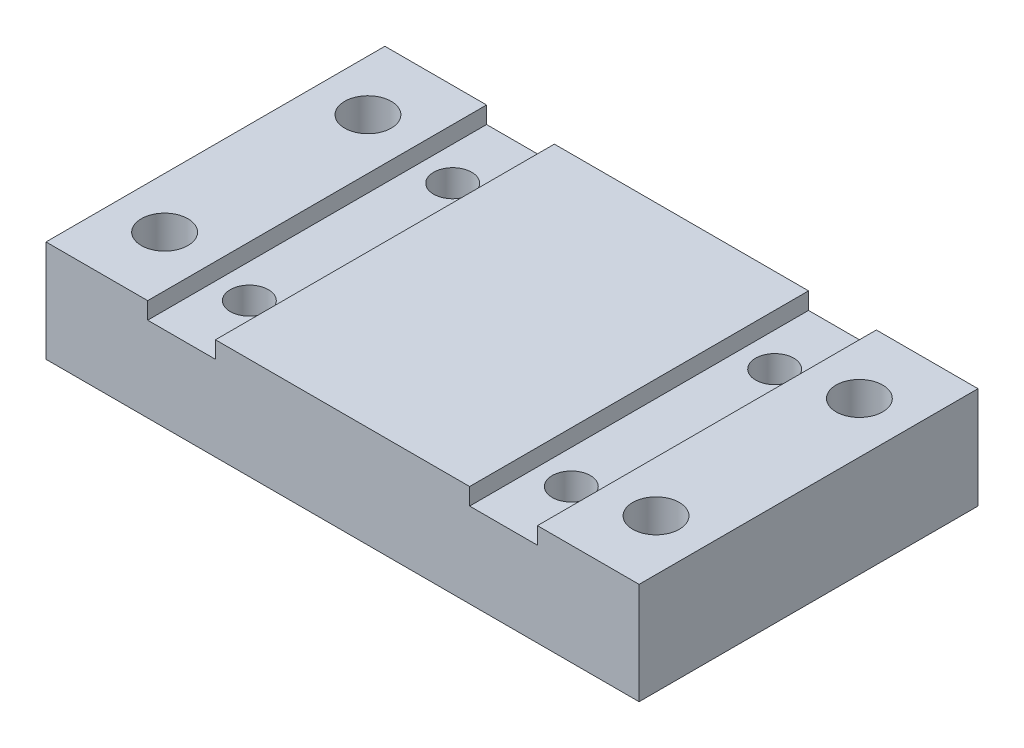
ISO-10303-21;
HEADER;
FILE_DESCRIPTION(('STEP AP214'),'2;1');
FILE_NAME('part.step','',(''),(''),'','','');
FILE_SCHEMA(('AUTOMOTIVE_DESIGN { 1 0 10303 214 1 1 1 1 }'));
ENDSEC;
DATA;
#1=APPLICATION_CONTEXT('core data for automotive mechanical design processes');
#2=APPLICATION_PROTOCOL_DEFINITION('international standard','automotive_design',2000,#1);
#3=PRODUCT_CONTEXT('',#1,'mechanical');
#4=PRODUCT('Part','Part','',(#3));
#5=PRODUCT_RELATED_PRODUCT_CATEGORY('part','',(#4));
#6=PRODUCT_DEFINITION_FORMATION('','',#4);
#7=PRODUCT_DEFINITION_CONTEXT('part definition',#1,'design');
#8=PRODUCT_DEFINITION('design','',#6,#7);
#9=PRODUCT_DEFINITION_SHAPE('','',#8);
#10=(LENGTH_UNIT() NAMED_UNIT(*) SI_UNIT(.MILLI.,.METRE.));
#11=(NAMED_UNIT(*) PLANE_ANGLE_UNIT() SI_UNIT($,.RADIAN.));
#12=(NAMED_UNIT(*) SI_UNIT($,.STERADIAN.) SOLID_ANGLE_UNIT());
#13=UNCERTAINTY_MEASURE_WITH_UNIT(LENGTH_MEASURE(1.E-05),#10,'distance_accuracy_value','');
#14=(GEOMETRIC_REPRESENTATION_CONTEXT(3) GLOBAL_UNCERTAINTY_ASSIGNED_CONTEXT((#13)) GLOBAL_UNIT_ASSIGNED_CONTEXT((#10,
#11,#12)) REPRESENTATION_CONTEXT('',''));
#15=CARTESIAN_POINT('',(0.,0.,0.));
#16=DIRECTION('',(0.,0.,1.));
#17=DIRECTION('',(1.,0.,0.));
#18=AXIS2_PLACEMENT_3D('',#15,#16,#17);
#19=CARTESIAN_POINT('',(-19.,0.,12.));
#20=DIRECTION('',(0.,1.,0.));
#21=DIRECTION('',(0.,0.,1.));
#22=AXIS2_PLACEMENT_3D('',#19,#20,#21);
#23=CYLINDRICAL_SURFACE('',#22,2.25);
#24=CARTESIAN_POINT('',(-19.,10.,12.));
#25=DIRECTION('',(0.,1.,0.));
#26=DIRECTION('',(0.,0.,1.));
#27=AXIS2_PLACEMENT_3D('',#24,#25,#26);
#28=CIRCLE('',#27,2.25);
#29=CARTESIAN_POINT('',(-19.,10.,14.25));
#30=VERTEX_POINT('',#29);
#31=EDGE_CURVE('E159',#30,#30,#28,.T.);
#32=ORIENTED_EDGE('',*,*,#31,.T.);
#33=EDGE_LOOP('',(#32));
#34=FACE_BOUND('',#33,.T.);
#35=CARTESIAN_POINT('',(-19.,4.,12.));
#36=DIRECTION('',(0.,1.,0.));
#37=DIRECTION('',(0.,0.,1.));
#38=AXIS2_PLACEMENT_3D('',#35,#36,#37);
#39=CIRCLE('',#38,2.25);
#40=CARTESIAN_POINT('',(-19.,4.,14.25));
#41=VERTEX_POINT('',#40);
#42=EDGE_CURVE('E162',#41,#41,#39,.T.);
#43=ORIENTED_EDGE('',*,*,#42,.F.);
#44=EDGE_LOOP('',(#43));
#45=FACE_BOUND('',#44,.T.);
#46=ADVANCED_FACE('F17',(#34,#45),#23,.F.);
#47=CARTESIAN_POINT('',(-19.,0.,-12.));
#48=DIRECTION('',(0.,1.,0.));
#49=DIRECTION('',(0.,0.,1.));
#50=AXIS2_PLACEMENT_3D('',#47,#48,#49);
#51=CYLINDRICAL_SURFACE('',#50,2.25);
#52=CARTESIAN_POINT('',(-19.,10.,-12.));
#53=DIRECTION('',(0.,1.,0.));
#54=DIRECTION('',(0.,0.,1.));
#55=AXIS2_PLACEMENT_3D('',#52,#53,#54);
#56=CIRCLE('',#55,2.25);
#57=CARTESIAN_POINT('',(-19.,10.,-9.74999999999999));
#58=VERTEX_POINT('',#57);
#59=EDGE_CURVE('E156',#58,#58,#56,.T.);
#60=ORIENTED_EDGE('',*,*,#59,.T.);
#61=EDGE_LOOP('',(#60));
#62=FACE_BOUND('',#61,.T.);
#63=CARTESIAN_POINT('',(-19.,4.,-12.));
#64=DIRECTION('',(0.,1.,0.));
#65=DIRECTION('',(0.,0.,1.));
#66=AXIS2_PLACEMENT_3D('',#63,#64,#65);
#67=CIRCLE('',#66,2.25);
#68=CARTESIAN_POINT('',(-19.,4.,-9.74999999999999));
#69=VERTEX_POINT('',#68);
#70=EDGE_CURVE('E221',#69,#69,#67,.T.);
#71=ORIENTED_EDGE('',*,*,#70,.F.);
#72=EDGE_LOOP('',(#71));
#73=FACE_BOUND('',#72,.T.);
#74=ADVANCED_FACE('F245',(#62,#73),#51,.F.);
#75=CARTESIAN_POINT('',(19.,0.,-12.));
#76=DIRECTION('',(0.,1.,0.));
#77=DIRECTION('',(0.,0.,1.));
#78=AXIS2_PLACEMENT_3D('',#75,#76,#77);
#79=CYLINDRICAL_SURFACE('',#78,2.25);
#80=CARTESIAN_POINT('',(19.,10.,-12.));
#81=DIRECTION('',(0.,1.,0.));
#82=DIRECTION('',(0.,0.,1.));
#83=AXIS2_PLACEMENT_3D('',#80,#81,#82);
#84=CIRCLE('',#83,2.25);
#85=CARTESIAN_POINT('',(19.,10.,-9.74999999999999));
#86=VERTEX_POINT('',#85);
#87=EDGE_CURVE('E150',#86,#86,#84,.T.);
#88=ORIENTED_EDGE('',*,*,#87,.T.);
#89=EDGE_LOOP('',(#88));
#90=FACE_BOUND('',#89,.T.);
#91=CARTESIAN_POINT('',(19.,4.,-12.));
#92=DIRECTION('',(0.,1.,0.));
#93=DIRECTION('',(0.,0.,1.));
#94=AXIS2_PLACEMENT_3D('',#91,#92,#93);
#95=CIRCLE('',#94,2.25);
#96=CARTESIAN_POINT('',(19.,4.,-9.74999999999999));
#97=VERTEX_POINT('',#96);
#98=EDGE_CURVE('E223',#97,#97,#95,.T.);
#99=ORIENTED_EDGE('',*,*,#98,.F.);
#100=EDGE_LOOP('',(#99));
#101=FACE_BOUND('',#100,.T.);
#102=ADVANCED_FACE('F235',(#90,#101),#79,.F.);
#103=CARTESIAN_POINT('',(19.,0.,12.));
#104=DIRECTION('',(0.,1.,0.));
#105=DIRECTION('',(0.,0.,1.));
#106=AXIS2_PLACEMENT_3D('',#103,#104,#105);
#107=CYLINDRICAL_SURFACE('',#106,2.25);
#108=CARTESIAN_POINT('',(19.,10.,12.));
#109=DIRECTION('',(0.,1.,0.));
#110=DIRECTION('',(0.,0.,1.));
#111=AXIS2_PLACEMENT_3D('',#108,#109,#110);
#112=CIRCLE('',#111,2.25);
#113=CARTESIAN_POINT('',(19.,10.,14.25));
#114=VERTEX_POINT('',#113);
#115=EDGE_CURVE('E148',#114,#114,#112,.T.);
#116=ORIENTED_EDGE('',*,*,#115,.T.);
#117=EDGE_LOOP('',(#116));
#118=FACE_BOUND('',#117,.T.);
#119=CARTESIAN_POINT('',(19.,4.,12.));
#120=DIRECTION('',(0.,1.,0.));
#121=DIRECTION('',(0.,0.,1.));
#122=AXIS2_PLACEMENT_3D('',#119,#120,#121);
#123=CIRCLE('',#122,2.25);
#124=CARTESIAN_POINT('',(19.,4.,14.25));
#125=VERTEX_POINT('',#124);
#126=EDGE_CURVE('E20',#125,#125,#123,.T.);
#127=ORIENTED_EDGE('',*,*,#126,.F.);
#128=EDGE_LOOP('',(#127));
#129=FACE_BOUND('',#128,.T.);
#130=ADVANCED_FACE('F233',(#118,#129),#107,.F.);
#131=CARTESIAN_POINT('',(19.,4.,12.));
#132=DIRECTION('',(0.,-1.,0.));
#133=DIRECTION('',(0.,0.,-1.));
#134=AXIS2_PLACEMENT_3D('',#131,#132,#133);
#135=PLANE('',#134);
#136=ORIENTED_EDGE('',*,*,#126,.T.);
#137=EDGE_LOOP('',(#136));
#138=FACE_BOUND('',#137,.T.);
#139=CARTESIAN_POINT('',(19.,4.,12.));
#140=DIRECTION('',(0.,-1.,0.));
#141=DIRECTION('',(0.,0.,-1.));
#142=AXIS2_PLACEMENT_3D('',#139,#140,#141);
#143=CIRCLE('',#142,4.);
#144=CARTESIAN_POINT('',(19.,4.,8.00000000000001));
#145=VERTEX_POINT('',#144);
#146=EDGE_CURVE('E145',#145,#145,#143,.T.);
#147=ORIENTED_EDGE('',*,*,#146,.T.);
#148=EDGE_LOOP('',(#147));
#149=FACE_BOUND('',#148,.T.);
#150=ADVANCED_FACE('F230',(#138,#149),#135,.T.);
#151=CARTESIAN_POINT('',(19.,4.,-12.));
#152=DIRECTION('',(0.,-1.,0.));
#153=DIRECTION('',(0.,0.,-1.));
#154=AXIS2_PLACEMENT_3D('',#151,#152,#153);
#155=PLANE('',#154);
#156=ORIENTED_EDGE('',*,*,#98,.T.);
#157=EDGE_LOOP('',(#156));
#158=FACE_BOUND('',#157,.T.);
#159=CARTESIAN_POINT('',(19.,4.,-12.));
#160=DIRECTION('',(0.,-1.,0.));
#161=DIRECTION('',(0.,0.,-1.));
#162=AXIS2_PLACEMENT_3D('',#159,#160,#161);
#163=CIRCLE('',#162,4.);
#164=CARTESIAN_POINT('',(19.,4.,-16.));
#165=VERTEX_POINT('',#164);
#166=EDGE_CURVE('E206',#165,#165,#163,.T.);
#167=ORIENTED_EDGE('',*,*,#166,.T.);
#168=EDGE_LOOP('',(#167));
#169=FACE_BOUND('',#168,.T.);
#170=ADVANCED_FACE('F243',(#158,#169),#155,.T.);
#171=CARTESIAN_POINT('',(-19.,4.,-12.));
#172=DIRECTION('',(0.,-1.,0.));
#173=DIRECTION('',(0.,0.,-1.));
#174=AXIS2_PLACEMENT_3D('',#171,#172,#173);
#175=PLANE('',#174);
#176=ORIENTED_EDGE('',*,*,#70,.T.);
#177=EDGE_LOOP('',(#176));
#178=FACE_BOUND('',#177,.T.);
#179=CARTESIAN_POINT('',(-19.,4.,-12.));
#180=DIRECTION('',(0.,-1.,0.));
#181=DIRECTION('',(0.,0.,-1.));
#182=AXIS2_PLACEMENT_3D('',#179,#180,#181);
#183=CIRCLE('',#182,4.);
#184=CARTESIAN_POINT('',(-19.,4.,-16.));
#185=VERTEX_POINT('',#184);
#186=EDGE_CURVE('E203',#185,#185,#183,.T.);
#187=ORIENTED_EDGE('',*,*,#186,.T.);
#188=EDGE_LOOP('',(#187));
#189=FACE_BOUND('',#188,.T.);
#190=ADVANCED_FACE('F336',(#178,#189),#175,.T.);
#191=CARTESIAN_POINT('',(-19.,4.,12.));
#192=DIRECTION('',(0.,-1.,0.));
#193=DIRECTION('',(0.,0.,-1.));
#194=AXIS2_PLACEMENT_3D('',#191,#192,#193);
#195=PLANE('',#194);
#196=ORIENTED_EDGE('',*,*,#42,.T.);
#197=EDGE_LOOP('',(#196));
#198=FACE_BOUND('',#197,.T.);
#199=CARTESIAN_POINT('',(-19.,4.,12.));
#200=DIRECTION('',(0.,-1.,0.));
#201=DIRECTION('',(0.,0.,-1.));
#202=AXIS2_PLACEMENT_3D('',#199,#200,#201);
#203=CIRCLE('',#202,4.);
#204=CARTESIAN_POINT('',(-19.,4.,8.00000000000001));
#205=VERTEX_POINT('',#204);
#206=EDGE_CURVE('E200',#205,#205,#203,.T.);
#207=ORIENTED_EDGE('',*,*,#206,.T.);
#208=EDGE_LOOP('',(#207));
#209=FACE_BOUND('',#208,.T.);
#210=ADVANCED_FACE('F332',(#198,#209),#195,.T.);
#211=CARTESIAN_POINT('',(15.,14.,-20.));
#212=DIRECTION('',(-1.,0.,0.));
#213=DIRECTION('',(0.,-1.,0.));
#214=AXIS2_PLACEMENT_3D('',#211,#212,#213);
#215=PLANE('',#214);
#216=DIRECTION('',(0.,0.,-1.));
#217=VECTOR('',#216,1.);
#218=CARTESIAN_POINT('',(15.,10.,-20.));
#219=LINE('',#218,#217);
#220=CARTESIAN_POINT('',(15.,10.,20.));
#221=VERTEX_POINT('',#220);
#222=CARTESIAN_POINT('',(15.,10.,-20.));
#223=VERTEX_POINT('',#222);
#224=EDGE_CURVE('E146',#221,#223,#219,.T.);
#225=ORIENTED_EDGE('',*,*,#224,.T.);
#226=DIRECTION('',(0.,1.,0.));
#227=VECTOR('',#226,1.);
#228=CARTESIAN_POINT('',(15.,12.,-20.));
#229=LINE('',#228,#227);
#230=CARTESIAN_POINT('',(15.,12.,-20.));
#231=VERTEX_POINT('',#230);
#232=EDGE_CURVE('E549',#223,#231,#229,.T.);
#233=ORIENTED_EDGE('',*,*,#232,.T.);
#234=DIRECTION('',(0.,0.,-1.));
#235=VECTOR('',#234,1.);
#236=CARTESIAN_POINT('',(15.,12.,0.));
#237=LINE('',#236,#235);
#238=CARTESIAN_POINT('',(15.,12.,20.));
#239=VERTEX_POINT('',#238);
#240=EDGE_CURVE('E160',#231,#239,#237,.F.);
#241=ORIENTED_EDGE('',*,*,#240,.T.);
#242=DIRECTION('',(0.,1.,0.));
#243=VECTOR('',#242,1.);
#244=CARTESIAN_POINT('',(15.,12.,20.));
#245=LINE('',#244,#243);
#246=EDGE_CURVE('E552',#239,#221,#245,.F.);
#247=ORIENTED_EDGE('',*,*,#246,.T.);
#248=EDGE_LOOP('',(#225,#233,#241,#247));
#249=FACE_BOUND('',#248,.T.);
#250=ADVANCED_FACE('F328',(#249),#215,.F.);
#251=CARTESIAN_POINT('',(0.,12.,0.));
#252=DIRECTION('',(0.,-1.,0.));
#253=DIRECTION('',(0.,0.,-1.));
#254=AXIS2_PLACEMENT_3D('',#251,#252,#253);
#255=PLANE('',#254);
#256=ORIENTED_EDGE('',*,*,#240,.F.);
#257=DIRECTION('',(1.,0.,0.));
#258=VECTOR('',#257,1.);
#259=CARTESIAN_POINT('',(-35.,12.,-20.));
#260=LINE('',#259,#258);
#261=CARTESIAN_POINT('',(-15.,12.,-20.));
#262=VERTEX_POINT('',#261);
#263=EDGE_CURVE('E563',#231,#262,#260,.F.);
#264=ORIENTED_EDGE('',*,*,#263,.T.);
#265=DIRECTION('',(0.,0.,1.));
#266=VECTOR('',#265,1.);
#267=CARTESIAN_POINT('',(-15.,12.,-20.));
#268=LINE('',#267,#266);
#269=CARTESIAN_POINT('',(-15.,12.,20.));
#270=VERTEX_POINT('',#269);
#271=EDGE_CURVE('E157',#262,#270,#268,.T.);
#272=ORIENTED_EDGE('',*,*,#271,.T.);
#273=DIRECTION('',(-1.,0.,0.));
#274=VECTOR('',#273,1.);
#275=CARTESIAN_POINT('',(-35.,12.,20.));
#276=LINE('',#275,#274);
#277=EDGE_CURVE('E576',#270,#239,#276,.F.);
#278=ORIENTED_EDGE('',*,*,#277,.T.);
#279=EDGE_LOOP('',(#256,#264,#272,#278));
#280=FACE_BOUND('',#279,.T.);
#281=ADVANCED_FACE('F324',(#280),#255,.F.);
#282=CARTESIAN_POINT('',(-15.,14.,-20.));
#283=DIRECTION('',(1.,0.,0.));
#284=DIRECTION('',(0.,1.,0.));
#285=AXIS2_PLACEMENT_3D('',#282,#283,#284);
#286=PLANE('',#285);
#287=DIRECTION('',(0.,0.,-1.));
#288=VECTOR('',#287,1.);
#289=CARTESIAN_POINT('',(-15.,10.,-20.));
#290=LINE('',#289,#288);
#291=CARTESIAN_POINT('',(-15.,10.,-20.));
#292=VERTEX_POINT('',#291);
#293=CARTESIAN_POINT('',(-15.,10.,20.));
#294=VERTEX_POINT('',#293);
#295=EDGE_CURVE('E154',#292,#294,#290,.F.);
#296=ORIENTED_EDGE('',*,*,#295,.T.);
#297=DIRECTION('',(0.,1.,0.));
#298=VECTOR('',#297,1.);
#299=CARTESIAN_POINT('',(-15.,12.,20.));
#300=LINE('',#299,#298);
#301=EDGE_CURVE('E579',#294,#270,#300,.T.);
#302=ORIENTED_EDGE('',*,*,#301,.T.);
#303=ORIENTED_EDGE('',*,*,#271,.F.);
#304=DIRECTION('',(0.,1.,0.));
#305=VECTOR('',#304,1.);
#306=CARTESIAN_POINT('',(-15.,12.,-20.));
#307=LINE('',#306,#305);
#308=EDGE_CURVE('E566',#262,#292,#307,.F.);
#309=ORIENTED_EDGE('',*,*,#308,.T.);
#310=EDGE_LOOP('',(#296,#302,#303,#309));
#311=FACE_BOUND('',#310,.T.);
#312=ADVANCED_FACE('F320',(#311),#286,.F.);
#313=CARTESIAN_POINT('',(-23.,10.,-20.));
#314=DIRECTION('',(0.,-1.,0.));
#315=DIRECTION('',(0.,0.,-1.));
#316=AXIS2_PLACEMENT_3D('',#313,#314,#315);
#317=PLANE('',#316);
#318=ORIENTED_EDGE('',*,*,#295,.F.);
#319=DIRECTION('',(1.,0.,0.));
#320=VECTOR('',#319,1.);
#321=CARTESIAN_POINT('',(-35.,10.,-20.));
#322=LINE('',#321,#320);
#323=CARTESIAN_POINT('',(-23.,10.,-20.));
#324=VERTEX_POINT('',#323);
#325=EDGE_CURVE('E593',#292,#324,#322,.F.);
#326=ORIENTED_EDGE('',*,*,#325,.T.);
#327=DIRECTION('',(0.,0.,1.));
#328=VECTOR('',#327,1.);
#329=CARTESIAN_POINT('',(-23.,10.,-20.));
#330=LINE('',#329,#328);
#331=CARTESIAN_POINT('',(-23.,10.,20.));
#332=VERTEX_POINT('',#331);
#333=EDGE_CURVE('E152',#324,#332,#330,.T.);
#334=ORIENTED_EDGE('',*,*,#333,.T.);
#335=DIRECTION('',(-1.,0.,0.));
#336=VECTOR('',#335,1.);
#337=CARTESIAN_POINT('',(-35.,10.,20.));
#338=LINE('',#337,#336);
#339=EDGE_CURVE('E582',#332,#294,#338,.F.);
#340=ORIENTED_EDGE('',*,*,#339,.T.);
#341=EDGE_LOOP('',(#318,#326,#334,#340));
#342=FACE_BOUND('',#341,.T.);
#343=ORIENTED_EDGE('',*,*,#59,.F.);
#344=EDGE_LOOP('',(#343));
#345=FACE_BOUND('',#344,.T.);
#346=ORIENTED_EDGE('',*,*,#31,.F.);
#347=EDGE_LOOP('',(#346));
#348=FACE_BOUND('',#347,.T.);
#349=ADVANCED_FACE('F317',(#342,#345,#348),#317,.F.);
#350=CARTESIAN_POINT('',(-23.,14.,-20.));
#351=DIRECTION('',(-1.,0.,0.));
#352=DIRECTION('',(0.,0.,1.));
#353=AXIS2_PLACEMENT_3D('',#350,#351,#352);
#354=PLANE('',#353);
#355=ORIENTED_EDGE('',*,*,#333,.F.);
#356=DIRECTION('',(0.,1.,0.));
#357=VECTOR('',#356,1.);
#358=CARTESIAN_POINT('',(-23.,12.,-20.));
#359=LINE('',#358,#357);
#360=CARTESIAN_POINT('',(-23.,12.,-20.));
#361=VERTEX_POINT('',#360);
#362=EDGE_CURVE('E594',#324,#361,#359,.T.);
#363=ORIENTED_EDGE('',*,*,#362,.T.);
#364=DIRECTION('',(0.,0.,-1.));
#365=VECTOR('',#364,1.);
#366=CARTESIAN_POINT('',(-23.,12.,0.));
#367=LINE('',#366,#365);
#368=CARTESIAN_POINT('',(-23.,12.,20.));
#369=VERTEX_POINT('',#368);
#370=EDGE_CURVE('E104',#361,#369,#367,.F.);
#371=ORIENTED_EDGE('',*,*,#370,.T.);
#372=DIRECTION('',(0.,1.,0.));
#373=VECTOR('',#372,1.);
#374=CARTESIAN_POINT('',(-23.,12.,20.));
#375=LINE('',#374,#373);
#376=EDGE_CURVE('E139',#369,#332,#375,.F.);
#377=ORIENTED_EDGE('',*,*,#376,.T.);
#378=EDGE_LOOP('',(#355,#363,#371,#377));
#379=FACE_BOUND('',#378,.T.);
#380=ADVANCED_FACE('F313',(#379),#354,.F.);
#381=CARTESIAN_POINT('',(0.,12.,0.));
#382=DIRECTION('',(0.,-1.,0.));
#383=DIRECTION('',(0.,0.,-1.));
#384=AXIS2_PLACEMENT_3D('',#381,#382,#383);
#385=PLANE('',#384);
#386=ORIENTED_EDGE('',*,*,#370,.F.);
#387=DIRECTION('',(1.,0.,0.));
#388=VECTOR('',#387,1.);
#389=CARTESIAN_POINT('',(-35.,12.,-20.));
#390=LINE('',#389,#388);
#391=CARTESIAN_POINT('',(-35.,12.,-20.));
#392=VERTEX_POINT('',#391);
#393=EDGE_CURVE('E596',#361,#392,#390,.F.);
#394=ORIENTED_EDGE('',*,*,#393,.T.);
#395=DIRECTION('',(0.,0.,-1.));
#396=VECTOR('',#395,1.);
#397=CARTESIAN_POINT('',(-35.,12.,20.));
#398=LINE('',#397,#396);
#399=CARTESIAN_POINT('',(-35.,12.,20.));
#400=VERTEX_POINT('',#399);
#401=EDGE_CURVE('E130',#392,#400,#398,.F.);
#402=ORIENTED_EDGE('',*,*,#401,.T.);
#403=DIRECTION('',(-1.,0.,0.));
#404=VECTOR('',#403,1.);
#405=CARTESIAN_POINT('',(-35.,12.,20.));
#406=LINE('',#405,#404);
#407=EDGE_CURVE('E137',#400,#369,#406,.F.);
#408=ORIENTED_EDGE('',*,*,#407,.T.);
#409=EDGE_LOOP('',(#386,#394,#402,#408));
#410=FACE_BOUND('',#409,.T.);
#411=CARTESIAN_POINT('',(-29.,12.,-12.));
#412=DIRECTION('',(0.,1.,0.));
#413=DIRECTION('',(0.,0.,1.));
#414=AXIS2_PLACEMENT_3D('',#411,#412,#413);
#415=CIRCLE('',#414,2.75);
#416=CARTESIAN_POINT('',(-29.,12.,-9.24999999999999));
#417=VERTEX_POINT('',#416);
#418=EDGE_CURVE('E119',#417,#417,#415,.F.);
#419=ORIENTED_EDGE('',*,*,#418,.T.);
#420=EDGE_LOOP('',(#419));
#421=FACE_BOUND('',#420,.T.);
#422=CARTESIAN_POINT('',(-29.,12.,12.));
#423=DIRECTION('',(0.,1.,0.));
#424=DIRECTION('',(0.,0.,1.));
#425=AXIS2_PLACEMENT_3D('',#422,#423,#424);
#426=CIRCLE('',#425,2.75);
#427=CARTESIAN_POINT('',(-29.,12.,14.75));
#428=VERTEX_POINT('',#427);
#429=EDGE_CURVE('E191',#428,#428,#426,.F.);
#430=ORIENTED_EDGE('',*,*,#429,.T.);
#431=EDGE_LOOP('',(#430));
#432=FACE_BOUND('',#431,.T.);
#433=ADVANCED_FACE('F310',(#410,#421,#432),#385,.F.);
#434=CARTESIAN_POINT('',(0.,12.,0.));
#435=DIRECTION('',(0.,-1.,0.));
#436=DIRECTION('',(0.,0.,-1.));
#437=AXIS2_PLACEMENT_3D('',#434,#435,#436);
#438=PLANE('',#437);
#439=DIRECTION('',(0.,0.,-1.));
#440=VECTOR('',#439,1.);
#441=CARTESIAN_POINT('',(23.,12.,-20.));
#442=LINE('',#441,#440);
#443=CARTESIAN_POINT('',(23.,12.,-20.));
#444=VERTEX_POINT('',#443);
#445=CARTESIAN_POINT('',(23.,12.,20.));
#446=VERTEX_POINT('',#445);
#447=EDGE_CURVE('E126',#444,#446,#442,.F.);
#448=ORIENTED_EDGE('',*,*,#447,.T.);
#449=DIRECTION('',(-1.,0.,0.));
#450=VECTOR('',#449,1.);
#451=CARTESIAN_POINT('',(-35.,12.,20.));
#452=LINE('',#451,#450);
#453=CARTESIAN_POINT('',(35.,12.,20.));
#454=VERTEX_POINT('',#453);
#455=EDGE_CURVE('E122',#446,#454,#452,.F.);
#456=ORIENTED_EDGE('',*,*,#455,.T.);
#457=DIRECTION('',(0.,0.,1.));
#458=VECTOR('',#457,1.);
#459=CARTESIAN_POINT('',(35.,12.,20.));
#460=LINE('',#459,#458);
#461=CARTESIAN_POINT('',(35.,12.,-20.));
#462=VERTEX_POINT('',#461);
#463=EDGE_CURVE('E109',#454,#462,#460,.F.);
#464=ORIENTED_EDGE('',*,*,#463,.T.);
#465=DIRECTION('',(1.,0.,0.));
#466=VECTOR('',#465,1.);
#467=CARTESIAN_POINT('',(-35.,12.,-20.));
#468=LINE('',#467,#466);
#469=EDGE_CURVE('E602',#462,#444,#468,.F.);
#470=ORIENTED_EDGE('',*,*,#469,.T.);
#471=EDGE_LOOP('',(#448,#456,#464,#470));
#472=FACE_BOUND('',#471,.T.);
#473=CARTESIAN_POINT('',(29.,12.,-12.));
#474=DIRECTION('',(0.,1.,0.));
#475=DIRECTION('',(0.,0.,1.));
#476=AXIS2_PLACEMENT_3D('',#473,#474,#475);
#477=CIRCLE('',#476,2.75);
#478=CARTESIAN_POINT('',(29.,12.,-9.24999999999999));
#479=VERTEX_POINT('',#478);
#480=EDGE_CURVE('E194',#479,#479,#477,.F.);
#481=ORIENTED_EDGE('',*,*,#480,.T.);
#482=EDGE_LOOP('',(#481));
#483=FACE_BOUND('',#482,.T.);
#484=CARTESIAN_POINT('',(29.,12.,12.));
#485=DIRECTION('',(0.,1.,0.));
#486=DIRECTION('',(0.,0.,1.));
#487=AXIS2_PLACEMENT_3D('',#484,#485,#486);
#488=CIRCLE('',#487,2.75);
#489=CARTESIAN_POINT('',(29.,12.,14.75));
#490=VERTEX_POINT('',#489);
#491=EDGE_CURVE('E197',#490,#490,#488,.F.);
#492=ORIENTED_EDGE('',*,*,#491,.T.);
#493=EDGE_LOOP('',(#492));
#494=FACE_BOUND('',#493,.T.);
#495=ADVANCED_FACE('F123',(#472,#483,#494),#438,.F.);
#496=CARTESIAN_POINT('',(23.,14.,-20.));
#497=DIRECTION('',(1.,0.,0.));
#498=DIRECTION('',(0.,0.,-1.));
#499=AXIS2_PLACEMENT_3D('',#496,#497,#498);
#500=PLANE('',#499);
#501=DIRECTION('',(0.,0.,-1.));
#502=VECTOR('',#501,1.);
#503=CARTESIAN_POINT('',(23.,10.,-20.));
#504=LINE('',#503,#502);
#505=CARTESIAN_POINT('',(23.,10.,-20.));
#506=VERTEX_POINT('',#505);
#507=CARTESIAN_POINT('',(23.,10.,20.));
#508=VERTEX_POINT('',#507);
#509=EDGE_CURVE('E143',#506,#508,#504,.F.);
#510=ORIENTED_EDGE('',*,*,#509,.T.);
#511=DIRECTION('',(0.,1.,0.));
#512=VECTOR('',#511,1.);
#513=CARTESIAN_POINT('',(23.,12.,20.));
#514=LINE('',#513,#512);
#515=EDGE_CURVE('E131',#508,#446,#514,.T.);
#516=ORIENTED_EDGE('',*,*,#515,.T.);
#517=ORIENTED_EDGE('',*,*,#447,.F.);
#518=DIRECTION('',(0.,1.,0.));
#519=VECTOR('',#518,1.);
#520=CARTESIAN_POINT('',(23.,12.,-20.));
#521=LINE('',#520,#519);
#522=EDGE_CURVE('E559',#444,#506,#521,.F.);
#523=ORIENTED_EDGE('',*,*,#522,.T.);
#524=EDGE_LOOP('',(#510,#516,#517,#523));
#525=FACE_BOUND('',#524,.T.);
#526=ADVANCED_FACE('F303',(#525),#500,.F.);
#527=CARTESIAN_POINT('',(15.,10.,-20.));
#528=DIRECTION('',(0.,-1.,0.));
#529=DIRECTION('',(0.,0.,-1.));
#530=AXIS2_PLACEMENT_3D('',#527,#528,#529);
#531=PLANE('',#530);
#532=ORIENTED_EDGE('',*,*,#509,.F.);
#533=DIRECTION('',(1.,0.,0.));
#534=VECTOR('',#533,1.);
#535=CARTESIAN_POINT('',(-35.,10.,-20.));
#536=LINE('',#535,#534);
#537=EDGE_CURVE('E188',#506,#223,#536,.F.);
#538=ORIENTED_EDGE('',*,*,#537,.T.);
#539=ORIENTED_EDGE('',*,*,#224,.F.);
#540=DIRECTION('',(-1.,0.,0.));
#541=VECTOR('',#540,1.);
#542=CARTESIAN_POINT('',(-35.,10.,20.));
#543=LINE('',#542,#541);
#544=EDGE_CURVE('E573',#221,#508,#543,.F.);
#545=ORIENTED_EDGE('',*,*,#544,.T.);
#546=EDGE_LOOP('',(#532,#538,#539,#545));
#547=FACE_BOUND('',#546,.T.);
#548=ORIENTED_EDGE('',*,*,#115,.F.);
#549=EDGE_LOOP('',(#548));
#550=FACE_BOUND('',#549,.T.);
#551=ORIENTED_EDGE('',*,*,#87,.F.);
#552=EDGE_LOOP('',(#551));
#553=FACE_BOUND('',#552,.T.);
#554=ADVANCED_FACE('F299',(#547,#550,#553),#531,.F.);
#555=CARTESIAN_POINT('',(19.,4.,12.));
#556=DIRECTION('',(0.,-1.,0.));
#557=DIRECTION('',(0.,0.,-1.));
#558=AXIS2_PLACEMENT_3D('',#555,#556,#557);
#559=CYLINDRICAL_SURFACE('',#558,4.);
#560=CARTESIAN_POINT('',(19.,0.,12.));
#561=DIRECTION('',(0.,-1.,0.));
#562=DIRECTION('',(0.,0.,-1.));
#563=AXIS2_PLACEMENT_3D('',#560,#561,#562);
#564=CIRCLE('',#563,4.);
#565=CARTESIAN_POINT('',(19.,0.,8.00000000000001));
#566=VERTEX_POINT('',#565);
#567=EDGE_CURVE('E185',#566,#566,#564,.F.);
#568=ORIENTED_EDGE('',*,*,#567,.F.);
#569=EDGE_LOOP('',(#568));
#570=FACE_BOUND('',#569,.T.);
#571=ORIENTED_EDGE('',*,*,#146,.F.);
#572=EDGE_LOOP('',(#571));
#573=FACE_BOUND('',#572,.T.);
#574=ADVANCED_FACE('F295',(#570,#573),#559,.F.);
#575=CARTESIAN_POINT('',(19.,4.,-12.));
#576=DIRECTION('',(0.,-1.,0.));
#577=DIRECTION('',(0.,0.,-1.));
#578=AXIS2_PLACEMENT_3D('',#575,#576,#577);
#579=CYLINDRICAL_SURFACE('',#578,4.);
#580=CARTESIAN_POINT('',(19.,0.,-12.));
#581=DIRECTION('',(0.,-1.,0.));
#582=DIRECTION('',(0.,0.,-1.));
#583=AXIS2_PLACEMENT_3D('',#580,#581,#582);
#584=CIRCLE('',#583,4.);
#585=CARTESIAN_POINT('',(19.,0.,-16.));
#586=VERTEX_POINT('',#585);
#587=EDGE_CURVE('E182',#586,#586,#584,.F.);
#588=ORIENTED_EDGE('',*,*,#587,.F.);
#589=EDGE_LOOP('',(#588));
#590=FACE_BOUND('',#589,.T.);
#591=ORIENTED_EDGE('',*,*,#166,.F.);
#592=EDGE_LOOP('',(#591));
#593=FACE_BOUND('',#592,.T.);
#594=ADVANCED_FACE('F291',(#590,#593),#579,.F.);
#595=CARTESIAN_POINT('',(-19.,4.,-12.));
#596=DIRECTION('',(0.,-1.,0.));
#597=DIRECTION('',(0.,0.,-1.));
#598=AXIS2_PLACEMENT_3D('',#595,#596,#597);
#599=CYLINDRICAL_SURFACE('',#598,4.);
#600=CARTESIAN_POINT('',(-19.,0.,-12.));
#601=DIRECTION('',(0.,-1.,0.));
#602=DIRECTION('',(0.,0.,-1.));
#603=AXIS2_PLACEMENT_3D('',#600,#601,#602);
#604=CIRCLE('',#603,4.);
#605=CARTESIAN_POINT('',(-19.,0.,-16.));
#606=VERTEX_POINT('',#605);
#607=EDGE_CURVE('E179',#606,#606,#604,.F.);
#608=ORIENTED_EDGE('',*,*,#607,.F.);
#609=EDGE_LOOP('',(#608));
#610=FACE_BOUND('',#609,.T.);
#611=ORIENTED_EDGE('',*,*,#186,.F.);
#612=EDGE_LOOP('',(#611));
#613=FACE_BOUND('',#612,.T.);
#614=ADVANCED_FACE('F287',(#610,#613),#599,.F.);
#615=CARTESIAN_POINT('',(-19.,4.,12.));
#616=DIRECTION('',(0.,-1.,0.));
#617=DIRECTION('',(0.,0.,-1.));
#618=AXIS2_PLACEMENT_3D('',#615,#616,#617);
#619=CYLINDRICAL_SURFACE('',#618,4.);
#620=CARTESIAN_POINT('',(-19.,0.,12.));
#621=DIRECTION('',(0.,-1.,0.));
#622=DIRECTION('',(0.,0.,-1.));
#623=AXIS2_PLACEMENT_3D('',#620,#621,#622);
#624=CIRCLE('',#623,4.);
#625=CARTESIAN_POINT('',(-19.,0.,8.00000000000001));
#626=VERTEX_POINT('',#625);
#627=EDGE_CURVE('E176',#626,#626,#624,.F.);
#628=ORIENTED_EDGE('',*,*,#627,.F.);
#629=EDGE_LOOP('',(#628));
#630=FACE_BOUND('',#629,.T.);
#631=ORIENTED_EDGE('',*,*,#206,.F.);
#632=EDGE_LOOP('',(#631));
#633=FACE_BOUND('',#632,.T.);
#634=ADVANCED_FACE('F283',(#630,#633),#619,.F.);
#635=CARTESIAN_POINT('',(29.,0.,12.));
#636=DIRECTION('',(0.,1.,0.));
#637=DIRECTION('',(0.,0.,1.));
#638=AXIS2_PLACEMENT_3D('',#635,#636,#637);
#639=CYLINDRICAL_SURFACE('',#638,2.75);
#640=ORIENTED_EDGE('',*,*,#491,.F.);
#641=EDGE_LOOP('',(#640));
#642=FACE_BOUND('',#641,.T.);
#643=CARTESIAN_POINT('',(29.,0.,12.));
#644=DIRECTION('',(0.,1.,0.));
#645=DIRECTION('',(0.,0.,1.));
#646=AXIS2_PLACEMENT_3D('',#643,#644,#645);
#647=CIRCLE('',#646,2.75);
#648=CARTESIAN_POINT('',(29.,0.,14.75));
#649=VERTEX_POINT('',#648);
#650=EDGE_CURVE('E173',#649,#649,#647,.T.);
#651=ORIENTED_EDGE('',*,*,#650,.F.);
#652=EDGE_LOOP('',(#651));
#653=FACE_BOUND('',#652,.T.);
#654=ADVANCED_FACE('F279',(#642,#653),#639,.F.);
#655=CARTESIAN_POINT('',(29.,0.,-12.));
#656=DIRECTION('',(0.,1.,0.));
#657=DIRECTION('',(0.,0.,1.));
#658=AXIS2_PLACEMENT_3D('',#655,#656,#657);
#659=CYLINDRICAL_SURFACE('',#658,2.75);
#660=ORIENTED_EDGE('',*,*,#480,.F.);
#661=EDGE_LOOP('',(#660));
#662=FACE_BOUND('',#661,.T.);
#663=CARTESIAN_POINT('',(29.,0.,-12.));
#664=DIRECTION('',(0.,1.,0.));
#665=DIRECTION('',(0.,0.,1.));
#666=AXIS2_PLACEMENT_3D('',#663,#664,#665);
#667=CIRCLE('',#666,2.75);
#668=CARTESIAN_POINT('',(29.,0.,-9.24999999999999));
#669=VERTEX_POINT('',#668);
#670=EDGE_CURVE('E170',#669,#669,#667,.T.);
#671=ORIENTED_EDGE('',*,*,#670,.F.);
#672=EDGE_LOOP('',(#671));
#673=FACE_BOUND('',#672,.T.);
#674=ADVANCED_FACE('F275',(#662,#673),#659,.F.);
#675=CARTESIAN_POINT('',(-29.,0.,12.));
#676=DIRECTION('',(0.,1.,0.));
#677=DIRECTION('',(0.,0.,1.));
#678=AXIS2_PLACEMENT_3D('',#675,#676,#677);
#679=CYLINDRICAL_SURFACE('',#678,2.75);
#680=ORIENTED_EDGE('',*,*,#429,.F.);
#681=EDGE_LOOP('',(#680));
#682=FACE_BOUND('',#681,.T.);
#683=CARTESIAN_POINT('',(-29.,0.,12.));
#684=DIRECTION('',(0.,1.,0.));
#685=DIRECTION('',(0.,0.,1.));
#686=AXIS2_PLACEMENT_3D('',#683,#684,#685);
#687=CIRCLE('',#686,2.75);
#688=CARTESIAN_POINT('',(-29.,0.,14.75));
#689=VERTEX_POINT('',#688);
#690=EDGE_CURVE('E167',#689,#689,#687,.T.);
#691=ORIENTED_EDGE('',*,*,#690,.F.);
#692=EDGE_LOOP('',(#691));
#693=FACE_BOUND('',#692,.T.);
#694=ADVANCED_FACE('F271',(#682,#693),#679,.F.);
#695=CARTESIAN_POINT('',(-29.,0.,-12.));
#696=DIRECTION('',(0.,1.,0.));
#697=DIRECTION('',(0.,0.,1.));
#698=AXIS2_PLACEMENT_3D('',#695,#696,#697);
#699=CYLINDRICAL_SURFACE('',#698,2.75);
#700=ORIENTED_EDGE('',*,*,#418,.F.);
#701=EDGE_LOOP('',(#700));
#702=FACE_BOUND('',#701,.T.);
#703=CARTESIAN_POINT('',(-29.,0.,-12.));
#704=DIRECTION('',(0.,1.,0.));
#705=DIRECTION('',(0.,0.,1.));
#706=AXIS2_PLACEMENT_3D('',#703,#704,#705);
#707=CIRCLE('',#706,2.75);
#708=CARTESIAN_POINT('',(-29.,0.,-9.24999999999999));
#709=VERTEX_POINT('',#708);
#710=EDGE_CURVE('E163',#709,#709,#707,.T.);
#711=ORIENTED_EDGE('',*,*,#710,.F.);
#712=EDGE_LOOP('',(#711));
#713=FACE_BOUND('',#712,.T.);
#714=ADVANCED_FACE('F268',(#702,#713),#699,.F.);
#715=CARTESIAN_POINT('',(35.,12.,20.));
#716=DIRECTION('',(-1.,0.,0.));
#717=DIRECTION('',(0.,0.,1.));
#718=AXIS2_PLACEMENT_3D('',#715,#716,#717);
#719=PLANE('',#718);
#720=DIRECTION('',(0.,1.,0.));
#721=VECTOR('',#720,1.);
#722=CARTESIAN_POINT('',(35.,12.,-20.));
#723=LINE('',#722,#721);
#724=CARTESIAN_POINT('',(35.,0.,-20.));
#725=VERTEX_POINT('',#724);
#726=EDGE_CURVE('E116',#725,#462,#723,.T.);
#727=ORIENTED_EDGE('',*,*,#726,.T.);
#728=ORIENTED_EDGE('',*,*,#463,.F.);
#729=DIRECTION('',(0.,1.,0.));
#730=VECTOR('',#729,1.);
#731=CARTESIAN_POINT('',(35.,12.,20.));
#732=LINE('',#731,#730);
#733=CARTESIAN_POINT('',(35.,0.,20.));
#734=VERTEX_POINT('',#733);
#735=EDGE_CURVE('E113',#454,#734,#732,.F.);
#736=ORIENTED_EDGE('',*,*,#735,.T.);
#737=DIRECTION('',(0.,0.,-1.));
#738=VECTOR('',#737,1.);
#739=CARTESIAN_POINT('',(35.,0.,0.));
#740=LINE('',#739,#738);
#741=EDGE_CURVE('E166',#725,#734,#740,.F.);
#742=ORIENTED_EDGE('',*,*,#741,.F.);
#743=EDGE_LOOP('',(#727,#728,#736,#742));
#744=FACE_BOUND('',#743,.T.);
#745=ADVANCED_FACE('F111',(#744),#719,.F.);
#746=CARTESIAN_POINT('',(-35.,12.,20.));
#747=DIRECTION('',(0.,0.,-1.));
#748=DIRECTION('',(-1.,0.,0.));
#749=AXIS2_PLACEMENT_3D('',#746,#747,#748);
#750=PLANE('',#749);
#751=ORIENTED_EDGE('',*,*,#515,.F.);
#752=ORIENTED_EDGE('',*,*,#544,.F.);
#753=ORIENTED_EDGE('',*,*,#246,.F.);
#754=ORIENTED_EDGE('',*,*,#277,.F.);
#755=ORIENTED_EDGE('',*,*,#301,.F.);
#756=ORIENTED_EDGE('',*,*,#339,.F.);
#757=ORIENTED_EDGE('',*,*,#376,.F.);
#758=ORIENTED_EDGE('',*,*,#407,.F.);
#759=DIRECTION('',(0.,1.,0.));
#760=VECTOR('',#759,1.);
#761=CARTESIAN_POINT('',(-35.,12.,20.));
#762=LINE('',#761,#760);
#763=CARTESIAN_POINT('',(-35.,0.,20.));
#764=VERTEX_POINT('',#763);
#765=EDGE_CURVE('E564',#400,#764,#762,.F.);
#766=ORIENTED_EDGE('',*,*,#765,.T.);
#767=DIRECTION('',(1.,0.,0.));
#768=VECTOR('',#767,1.);
#769=CARTESIAN_POINT('',(0.,0.,20.));
#770=LINE('',#769,#768);
#771=EDGE_CURVE('E135',#734,#764,#770,.F.);
#772=ORIENTED_EDGE('',*,*,#771,.F.);
#773=ORIENTED_EDGE('',*,*,#735,.F.);
#774=ORIENTED_EDGE('',*,*,#455,.F.);
#775=EDGE_LOOP('',(#751,#752,#753,#754,#755,#756,#757,#758,#766,#772,#773,#774));
#776=FACE_BOUND('',#775,.T.);
#777=ADVANCED_FACE('F133',(#776),#750,.F.);
#778=CARTESIAN_POINT('',(-35.,12.,20.));
#779=DIRECTION('',(1.,0.,0.));
#780=DIRECTION('',(0.,0.,-1.));
#781=AXIS2_PLACEMENT_3D('',#778,#779,#780);
#782=PLANE('',#781);
#783=ORIENTED_EDGE('',*,*,#765,.F.);
#784=ORIENTED_EDGE('',*,*,#401,.F.);
#785=DIRECTION('',(0.,1.,0.));
#786=VECTOR('',#785,1.);
#787=CARTESIAN_POINT('',(-35.,12.,-20.));
#788=LINE('',#787,#786);
#789=CARTESIAN_POINT('',(-35.,0.,-20.));
#790=VERTEX_POINT('',#789);
#791=EDGE_CURVE('E35',#392,#790,#788,.F.);
#792=ORIENTED_EDGE('',*,*,#791,.T.);
#793=DIRECTION('',(0.,0.,-1.));
#794=VECTOR('',#793,1.);
#795=CARTESIAN_POINT('',(-35.,0.,0.));
#796=LINE('',#795,#794);
#797=EDGE_CURVE('E26',#764,#790,#796,.T.);
#798=ORIENTED_EDGE('',*,*,#797,.F.);
#799=EDGE_LOOP('',(#783,#784,#792,#798));
#800=FACE_BOUND('',#799,.T.);
#801=ADVANCED_FACE('F256',(#800),#782,.F.);
#802=CARTESIAN_POINT('',(-35.,12.,-20.));
#803=DIRECTION('',(0.,0.,1.));
#804=DIRECTION('',(1.,0.,0.));
#805=AXIS2_PLACEMENT_3D('',#802,#803,#804);
#806=PLANE('',#805);
#807=ORIENTED_EDGE('',*,*,#522,.F.);
#808=ORIENTED_EDGE('',*,*,#469,.F.);
#809=ORIENTED_EDGE('',*,*,#726,.F.);
#810=DIRECTION('',(1.,0.,0.));
#811=VECTOR('',#810,1.);
#812=CARTESIAN_POINT('',(0.,0.,-20.));
#813=LINE('',#812,#811);
#814=EDGE_CURVE('E11',#790,#725,#813,.T.);
#815=ORIENTED_EDGE('',*,*,#814,.F.);
#816=ORIENTED_EDGE('',*,*,#791,.F.);
#817=ORIENTED_EDGE('',*,*,#393,.F.);
#818=ORIENTED_EDGE('',*,*,#362,.F.);
#819=ORIENTED_EDGE('',*,*,#325,.F.);
#820=ORIENTED_EDGE('',*,*,#308,.F.);
#821=ORIENTED_EDGE('',*,*,#263,.F.);
#822=ORIENTED_EDGE('',*,*,#232,.F.);
#823=ORIENTED_EDGE('',*,*,#537,.F.);
#824=EDGE_LOOP('',(#807,#808,#809,#815,#816,#817,#818,#819,#820,#821,#822,#823));
#825=FACE_BOUND('',#824,.T.);
#826=ADVANCED_FACE('F250',(#825),#806,.F.);
#827=CARTESIAN_POINT('',(0.,0.,0.));
#828=DIRECTION('',(0.,-1.,0.));
#829=DIRECTION('',(0.,0.,-1.));
#830=AXIS2_PLACEMENT_3D('',#827,#828,#829);
#831=PLANE('',#830);
#832=ORIENTED_EDGE('',*,*,#797,.T.);
#833=ORIENTED_EDGE('',*,*,#814,.T.);
#834=ORIENTED_EDGE('',*,*,#741,.T.);
#835=ORIENTED_EDGE('',*,*,#771,.T.);
#836=EDGE_LOOP('',(#832,#833,#834,#835));
#837=FACE_BOUND('',#836,.T.);
#838=ORIENTED_EDGE('',*,*,#710,.T.);
#839=EDGE_LOOP('',(#838));
#840=FACE_BOUND('',#839,.T.);
#841=ORIENTED_EDGE('',*,*,#690,.T.);
#842=EDGE_LOOP('',(#841));
#843=FACE_BOUND('',#842,.T.);
#844=ORIENTED_EDGE('',*,*,#670,.T.);
#845=EDGE_LOOP('',(#844));
#846=FACE_BOUND('',#845,.T.);
#847=ORIENTED_EDGE('',*,*,#650,.T.);
#848=EDGE_LOOP('',(#847));
#849=FACE_BOUND('',#848,.T.);
#850=ORIENTED_EDGE('',*,*,#627,.T.);
#851=EDGE_LOOP('',(#850));
#852=FACE_BOUND('',#851,.T.);
#853=ORIENTED_EDGE('',*,*,#607,.T.);
#854=EDGE_LOOP('',(#853));
#855=FACE_BOUND('',#854,.T.);
#856=ORIENTED_EDGE('',*,*,#587,.T.);
#857=EDGE_LOOP('',(#856));
#858=FACE_BOUND('',#857,.T.);
#859=ORIENTED_EDGE('',*,*,#567,.T.);
#860=EDGE_LOOP('',(#859));
#861=FACE_BOUND('',#860,.T.);
#862=ADVANCED_FACE('F248',(#837,#840,#843,#846,#849,#852,#855,#858,#861),#831,.T.);
#863=CLOSED_SHELL('',(#46,#74,#102,#130,#150,#170,#190,#210,#250,#281,#312,#349,#380,#433,#495,
#526,#554,#574,#594,#614,#634,#654,#674,#694,#714,#745,#777,#801,#826,#862));
#864=MANIFOLD_SOLID_BREP('B1',#863);
#865=ADVANCED_BREP_SHAPE_REPRESENTATION('',(#18,#864),#14);
#866=SHAPE_DEFINITION_REPRESENTATION(#9,#865);
ENDSEC;
END-ISO-10303-21;
